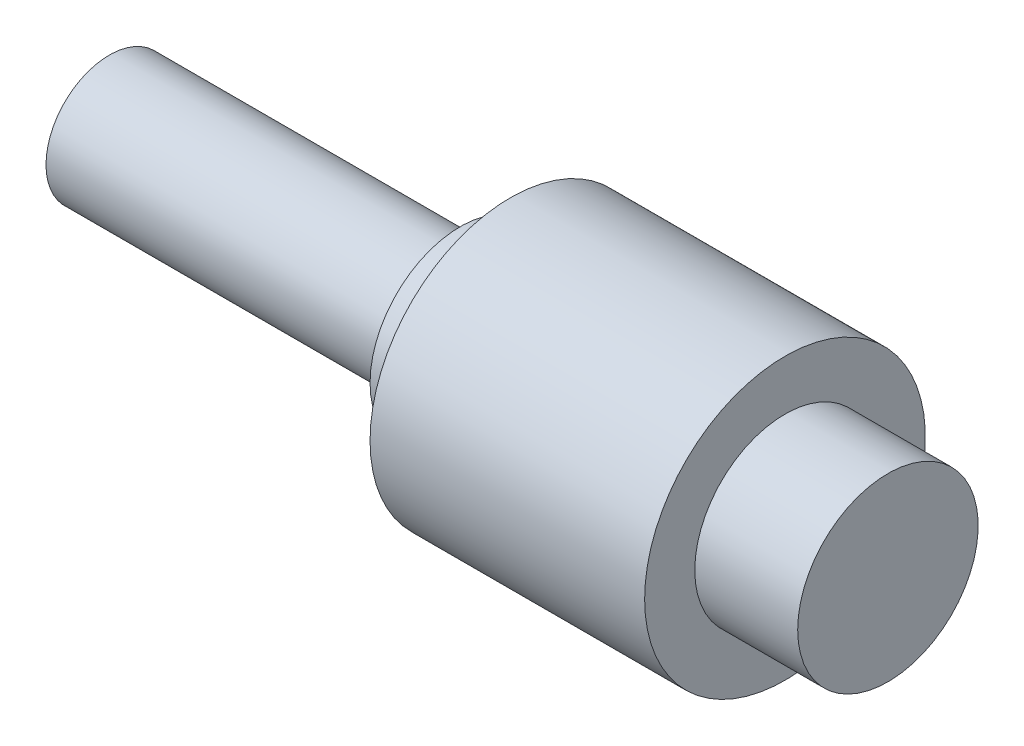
ISO-10303-21;
HEADER;
FILE_DESCRIPTION(('STEP AP214'),'2;1');
FILE_NAME('part.step','',(''),(''),'','','');
FILE_SCHEMA(('AUTOMOTIVE_DESIGN { 1 0 10303 214 1 1 1 1 }'));
ENDSEC;
DATA;
#1=APPLICATION_CONTEXT('core data for automotive mechanical design processes');
#2=APPLICATION_PROTOCOL_DEFINITION('international standard','automotive_design',2000,#1);
#3=PRODUCT_CONTEXT('',#1,'mechanical');
#4=PRODUCT('Part','Part','',(#3));
#5=PRODUCT_RELATED_PRODUCT_CATEGORY('part','',(#4));
#6=PRODUCT_DEFINITION_FORMATION('','',#4);
#7=PRODUCT_DEFINITION_CONTEXT('part definition',#1,'design');
#8=PRODUCT_DEFINITION('design','',#6,#7);
#9=PRODUCT_DEFINITION_SHAPE('','',#8);
#10=(LENGTH_UNIT() NAMED_UNIT(*) SI_UNIT(.MILLI.,.METRE.));
#11=(NAMED_UNIT(*) PLANE_ANGLE_UNIT() SI_UNIT($,.RADIAN.));
#12=(NAMED_UNIT(*) SI_UNIT($,.STERADIAN.) SOLID_ANGLE_UNIT());
#13=UNCERTAINTY_MEASURE_WITH_UNIT(LENGTH_MEASURE(1.E-05),#10,'distance_accuracy_value','');
#14=(GEOMETRIC_REPRESENTATION_CONTEXT(3) GLOBAL_UNCERTAINTY_ASSIGNED_CONTEXT((#13)) GLOBAL_UNIT_ASSIGNED_CONTEXT((#10,
#11,#12)) REPRESENTATION_CONTEXT('',''));
#15=CARTESIAN_POINT('',(0.,0.,0.));
#16=DIRECTION('',(0.,0.,1.));
#17=DIRECTION('',(1.,0.,0.));
#18=AXIS2_PLACEMENT_3D('',#15,#16,#17);
#19=CARTESIAN_POINT('',(40.,0.,0.));
#20=DIRECTION('',(-1.,0.,0.));
#21=DIRECTION('',(0.,0.,1.));
#22=AXIS2_PLACEMENT_3D('',#19,#20,#21);
#23=PLANE('',#22);
#24=CARTESIAN_POINT('',(40.,0.,0.));
#25=DIRECTION('',(-1.,0.,0.));
#26=DIRECTION('',(0.,0.,1.));
#27=AXIS2_PLACEMENT_3D('',#24,#25,#26);
#28=CIRCLE('',#27,9.);
#29=CARTESIAN_POINT('',(40.,0.,9.));
#30=VERTEX_POINT('',#29);
#31=EDGE_CURVE('E10',#30,#30,#28,.T.);
#32=ORIENTED_EDGE('',*,*,#31,.F.);
#33=EDGE_LOOP('',(#32));
#34=FACE_BOUND('',#33,.T.);
#35=ADVANCED_FACE('F37',(#34),#23,.F.);
#36=CARTESIAN_POINT('',(-37.6517666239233,0.,0.));
#37=DIRECTION('',(-1.,0.,0.));
#38=DIRECTION('',(0.,0.,1.));
#39=AXIS2_PLACEMENT_3D('',#36,#37,#38);
#40=CYLINDRICAL_SURFACE('',#39,9.);
#41=ORIENTED_EDGE('',*,*,#31,.T.);
#42=EDGE_LOOP('',(#41));
#43=FACE_BOUND('',#42,.T.);
#44=CARTESIAN_POINT('',(29.7340186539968,0.,0.));
#45=DIRECTION('',(-1.,0.,0.));
#46=DIRECTION('',(0.,0.,1.));
#47=AXIS2_PLACEMENT_3D('',#44,#45,#46);
#48=CIRCLE('',#47,9.);
#49=CARTESIAN_POINT('',(29.7340186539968,0.,9.));
#50=VERTEX_POINT('',#49);
#51=EDGE_CURVE('E44',#50,#50,#48,.T.);
#52=ORIENTED_EDGE('',*,*,#51,.F.);
#53=EDGE_LOOP('',(#52));
#54=FACE_BOUND('',#53,.T.);
#55=ADVANCED_FACE('F93',(#43,#54),#40,.T.);
#56=CARTESIAN_POINT('',(29.7340186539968,14.,0.));
#57=DIRECTION('',(1.,0.,0.));
#58=DIRECTION('',(0.,0.,-1.));
#59=AXIS2_PLACEMENT_3D('',#56,#57,#58);
#60=PLANE('',#59);
#61=ORIENTED_EDGE('',*,*,#51,.T.);
#62=EDGE_LOOP('',(#61));
#63=FACE_BOUND('',#62,.T.);
#64=CARTESIAN_POINT('',(29.7340186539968,0.,0.));
#65=DIRECTION('',(-1.,0.,0.));
#66=DIRECTION('',(0.,0.,1.));
#67=AXIS2_PLACEMENT_3D('',#64,#65,#66);
#68=CIRCLE('',#67,14.);
#69=CARTESIAN_POINT('',(29.7340186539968,0.,14.));
#70=VERTEX_POINT('',#69);
#71=EDGE_CURVE('E49',#70,#70,#68,.T.);
#72=ORIENTED_EDGE('',*,*,#71,.F.);
#73=EDGE_LOOP('',(#72));
#74=FACE_BOUND('',#73,.T.);
#75=ADVANCED_FACE('F98',(#63,#74),#60,.T.);
#76=CARTESIAN_POINT('',(-37.6517666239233,0.,0.));
#77=DIRECTION('',(-1.,0.,0.));
#78=DIRECTION('',(0.,0.,1.));
#79=AXIS2_PLACEMENT_3D('',#76,#77,#78);
#80=CYLINDRICAL_SURFACE('',#79,14.);
#81=ORIENTED_EDGE('',*,*,#71,.T.);
#82=EDGE_LOOP('',(#81));
#83=FACE_BOUND('',#82,.T.);
#84=CARTESIAN_POINT('',(2.34823337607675,0.,0.));
#85=DIRECTION('',(-1.,0.,0.));
#86=DIRECTION('',(0.,0.,1.));
#87=AXIS2_PLACEMENT_3D('',#84,#85,#86);
#88=CIRCLE('',#87,14.);
#89=CARTESIAN_POINT('',(2.34823337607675,0.,14.));
#90=VERTEX_POINT('',#89);
#91=EDGE_CURVE('E54',#90,#90,#88,.T.);
#92=ORIENTED_EDGE('',*,*,#91,.F.);
#93=EDGE_LOOP('',(#92));
#94=FACE_BOUND('',#93,.T.);
#95=ADVANCED_FACE('F102',(#83,#94),#80,.T.);
#96=CARTESIAN_POINT('',(2.34823337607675,14.,0.));
#97=DIRECTION('',(1.,0.,0.));
#98=DIRECTION('',(0.,0.,-1.));
#99=AXIS2_PLACEMENT_3D('',#96,#97,#98);
#100=PLANE('',#99);
#101=CARTESIAN_POINT('',(2.34823337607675,0.,0.));
#102=DIRECTION('',(-1.,0.,0.));
#103=DIRECTION('',(0.,0.,1.));
#104=AXIS2_PLACEMENT_3D('',#101,#102,#103);
#105=CIRCLE('',#104,9.);
#106=CARTESIAN_POINT('',(2.34823337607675,0.,9.));
#107=VERTEX_POINT('',#106);
#108=EDGE_CURVE('E60',#107,#107,#105,.T.);
#109=ORIENTED_EDGE('',*,*,#108,.F.);
#110=EDGE_LOOP('',(#109));
#111=FACE_BOUND('',#110,.T.);
#112=ORIENTED_EDGE('',*,*,#91,.T.);
#113=EDGE_LOOP('',(#112));
#114=FACE_BOUND('',#113,.T.);
#115=ADVANCED_FACE('F108',(#111,#114),#100,.F.);
#116=CARTESIAN_POINT('',(-37.6517666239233,0.,0.));
#117=DIRECTION('',(-1.,0.,0.));
#118=DIRECTION('',(0.,0.,1.));
#119=AXIS2_PLACEMENT_3D('',#116,#117,#118);
#120=CYLINDRICAL_SURFACE('',#119,9.);
#121=ORIENTED_EDGE('',*,*,#108,.T.);
#122=EDGE_LOOP('',(#121));
#123=FACE_BOUND('',#122,.T.);
#124=CARTESIAN_POINT('',(-2.65176662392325,0.,0.));
#125=DIRECTION('',(-1.,0.,0.));
#126=DIRECTION('',(0.,0.,1.));
#127=AXIS2_PLACEMENT_3D('',#124,#125,#126);
#128=CIRCLE('',#127,9.);
#129=CARTESIAN_POINT('',(-2.65176662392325,0.,9.));
#130=VERTEX_POINT('',#129);
#131=EDGE_CURVE('E64',#130,#130,#128,.T.);
#132=ORIENTED_EDGE('',*,*,#131,.F.);
#133=EDGE_LOOP('',(#132));
#134=FACE_BOUND('',#133,.T.);
#135=ADVANCED_FACE('F89',(#123,#134),#120,.T.);
#136=CARTESIAN_POINT('',(-2.65176662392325,6.31917761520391,0.));
#137=DIRECTION('',(-1.,0.,0.));
#138=DIRECTION('',(0.,0.,1.));
#139=AXIS2_PLACEMENT_3D('',#136,#137,#138);
#140=PLANE('',#139);
#141=ORIENTED_EDGE('',*,*,#131,.T.);
#142=EDGE_LOOP('',(#141));
#143=FACE_BOUND('',#142,.T.);
#144=CARTESIAN_POINT('',(-2.65176662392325,0.,0.));
#145=DIRECTION('',(-1.,0.,0.));
#146=DIRECTION('',(0.,0.,1.));
#147=AXIS2_PLACEMENT_3D('',#144,#145,#146);
#148=CIRCLE('',#147,6.31917761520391);
#149=CARTESIAN_POINT('',(-2.65176662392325,0.,6.31917761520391));
#150=VERTEX_POINT('',#149);
#151=EDGE_CURVE('E68',#150,#150,#148,.T.);
#152=ORIENTED_EDGE('',*,*,#151,.F.);
#153=EDGE_LOOP('',(#152));
#154=FACE_BOUND('',#153,.T.);
#155=ADVANCED_FACE('F81',(#143,#154),#140,.T.);
#156=CARTESIAN_POINT('',(-37.6517666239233,0.,0.));
#157=DIRECTION('',(-1.,0.,0.));
#158=DIRECTION('',(0.,0.,1.));
#159=AXIS2_PLACEMENT_3D('',#156,#157,#158);
#160=CYLINDRICAL_SURFACE('',#159,6.31917761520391);
#161=ORIENTED_EDGE('',*,*,#151,.T.);
#162=EDGE_LOOP('',(#161));
#163=FACE_BOUND('',#162,.T.);
#164=CARTESIAN_POINT('',(-37.6517666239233,0.,0.));
#165=DIRECTION('',(-1.,0.,0.));
#166=DIRECTION('',(0.,0.,1.));
#167=AXIS2_PLACEMENT_3D('',#164,#165,#166);
#168=CIRCLE('',#167,6.31917761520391);
#169=CARTESIAN_POINT('',(-37.6517666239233,0.,6.31917761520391));
#170=VERTEX_POINT('',#169);
#171=EDGE_CURVE('E72',#170,#170,#168,.T.);
#172=ORIENTED_EDGE('',*,*,#171,.F.);
#173=EDGE_LOOP('',(#172));
#174=FACE_BOUND('',#173,.T.);
#175=ADVANCED_FACE('F79',(#163,#174),#160,.T.);
#176=CARTESIAN_POINT('',(-37.6517666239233,6.31917761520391,0.));
#177=DIRECTION('',(1.,0.,0.));
#178=DIRECTION('',(0.,0.,-1.));
#179=AXIS2_PLACEMENT_3D('',#176,#177,#178);
#180=PLANE('',#179);
#181=ORIENTED_EDGE('',*,*,#171,.T.);
#182=EDGE_LOOP('',(#181));
#183=FACE_BOUND('',#182,.T.);
#184=ADVANCED_FACE('F77',(#183),#180,.F.);
#185=CLOSED_SHELL('',(#35,#55,#75,#95,#115,#135,#155,#175,#184));
#186=MANIFOLD_SOLID_BREP('B2',#185);
#187=ADVANCED_BREP_SHAPE_REPRESENTATION('',(#18,#186),#14);
#188=SHAPE_DEFINITION_REPRESENTATION(#9,#187);
ENDSEC;
END-ISO-10303-21;
